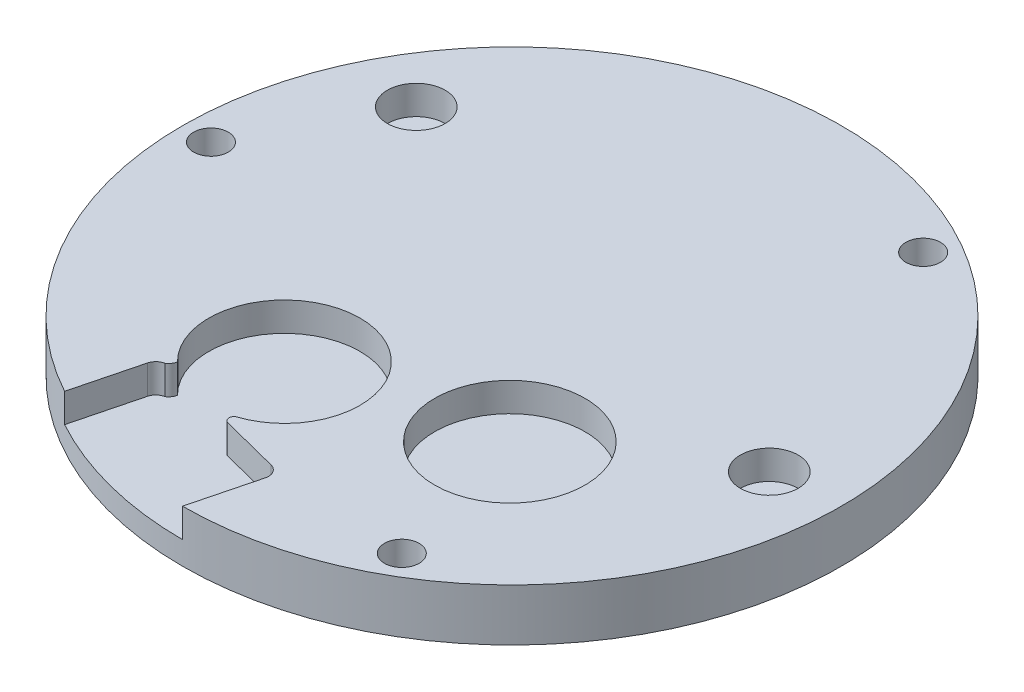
ISO-10303-21;
HEADER;
FILE_DESCRIPTION(('STEP AP214'),'2;1');
FILE_NAME('part.step','',(''),(''),'','','');
FILE_SCHEMA(('AUTOMOTIVE_DESIGN { 1 0 10303 214 1 1 1 1 }'));
ENDSEC;
DATA;
#1=APPLICATION_CONTEXT('core data for automotive mechanical design processes');
#2=APPLICATION_PROTOCOL_DEFINITION('international standard','automotive_design',2000,#1);
#3=PRODUCT_CONTEXT('',#1,'mechanical');
#4=PRODUCT('Part','Part','',(#3));
#5=PRODUCT_RELATED_PRODUCT_CATEGORY('part','',(#4));
#6=PRODUCT_DEFINITION_FORMATION('','',#4);
#7=PRODUCT_DEFINITION_CONTEXT('part definition',#1,'design');
#8=PRODUCT_DEFINITION('design','',#6,#7);
#9=PRODUCT_DEFINITION_SHAPE('','',#8);
#10=(LENGTH_UNIT() NAMED_UNIT(*) SI_UNIT(.MILLI.,.METRE.));
#11=(NAMED_UNIT(*) PLANE_ANGLE_UNIT() SI_UNIT($,.RADIAN.));
#12=(NAMED_UNIT(*) SI_UNIT($,.STERADIAN.) SOLID_ANGLE_UNIT());
#13=UNCERTAINTY_MEASURE_WITH_UNIT(LENGTH_MEASURE(1.E-05),#10,'distance_accuracy_value','');
#14=(GEOMETRIC_REPRESENTATION_CONTEXT(3) GLOBAL_UNCERTAINTY_ASSIGNED_CONTEXT((#13)) GLOBAL_UNIT_ASSIGNED_CONTEXT((#10,
#11,#12)) REPRESENTATION_CONTEXT('',''));
#15=CARTESIAN_POINT('',(0.,0.,0.));
#16=DIRECTION('',(0.,0.,1.));
#17=DIRECTION('',(1.,0.,0.));
#18=AXIS2_PLACEMENT_3D('',#15,#16,#17);
#19=CARTESIAN_POINT('',(0.,9.,0.));
#20=DIRECTION('',(0.,-1.,0.));
#21=DIRECTION('',(0.,0.,-1.));
#22=AXIS2_PLACEMENT_3D('',#19,#20,#21);
#23=CYLINDRICAL_SURFACE('',#22,57.);
#24=CARTESIAN_POINT('',(1.52655665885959E-13,4.,-5.62050406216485E-13));
#25=DIRECTION('',(0.,1.,0.));
#26=DIRECTION('',(0.,0.,-1.));
#27=AXIS2_PLACEMENT_3D('',#24,#25,#26);
#28=CIRCLE('',#27,57.0000000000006);
#29=CARTESIAN_POINT('',(-27.404440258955,4.,49.97996252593));
#30=VERTEX_POINT('',#29);
#31=CARTESIAN_POINT('',(0.,4.,57.));
#32=VERTEX_POINT('',#31);
#33=EDGE_CURVE('E180',#30,#32,#28,.T.);
#34=ORIENTED_EDGE('',*,*,#33,.F.);
#35=DIRECTION('',(0.,1.,0.));
#36=VECTOR('',#35,1.);
#37=CARTESIAN_POINT('',(-27.404440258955,4.,49.97996252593));
#38=LINE('',#37,#36);
#39=CARTESIAN_POINT('',(-27.404440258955,9.,49.97996252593));
#40=VERTEX_POINT('',#39);
#41=EDGE_CURVE('E219',#30,#40,#38,.T.);
#42=ORIENTED_EDGE('',*,*,#41,.T.);
#43=CARTESIAN_POINT('',(0.,9.,0.));
#44=DIRECTION('',(0.,1.,0.));
#45=DIRECTION('',(0.,0.,1.));
#46=AXIS2_PLACEMENT_3D('',#43,#44,#45);
#47=CIRCLE('',#46,57.);
#48=CARTESIAN_POINT('',(0.,9.,57.));
#49=VERTEX_POINT('',#48);
#50=EDGE_CURVE('E49',#49,#40,#47,.T.);
#51=ORIENTED_EDGE('',*,*,#50,.F.);
#52=DIRECTION('',(0.,1.,0.));
#53=VECTOR('',#52,1.);
#54=CARTESIAN_POINT('',(0.,4.,57.));
#55=LINE('',#54,#53);
#56=EDGE_CURVE('E64',#32,#49,#55,.T.);
#57=ORIENTED_EDGE('',*,*,#56,.F.);
#58=EDGE_LOOP('',(#34,#42,#51,#57));
#59=FACE_BOUND('',#58,.T.);
#60=CARTESIAN_POINT('',(0.,0.,0.));
#61=DIRECTION('',(0.,1.,0.));
#62=DIRECTION('',(0.,0.,1.));
#63=AXIS2_PLACEMENT_3D('',#60,#61,#62);
#64=CIRCLE('',#63,57.);
#65=CARTESIAN_POINT('',(0.,0.,57.));
#66=VERTEX_POINT('',#65);
#67=EDGE_CURVE('E254',#66,#66,#64,.T.);
#68=ORIENTED_EDGE('',*,*,#67,.T.);
#69=EDGE_LOOP('',(#68));
#70=FACE_BOUND('',#69,.T.);
#71=ADVANCED_FACE('F41',(#59,#70),#23,.T.);
#72=CARTESIAN_POINT('',(0.,9.,0.));
#73=DIRECTION('',(0.,1.,0.));
#74=DIRECTION('',(0.,0.,1.));
#75=AXIS2_PLACEMENT_3D('',#72,#73,#74);
#76=PLANE('',#75);
#77=CARTESIAN_POINT('',(-8.33064167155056,9.,39.7365276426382));
#78=DIRECTION('',(0.,-1.,0.));
#79=DIRECTION('',(0.,0.,1.));
#80=AXIS2_PLACEMENT_3D('',#77,#78,#79);
#81=CIRCLE('',#80,0.881146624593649);
#82=CARTESIAN_POINT('',(-8.65172272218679,9.,40.5570922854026));
#83=VERTEX_POINT('',#82);
#84=CARTESIAN_POINT('',(-8.77437966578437,9.,38.9752681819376));
#85=VERTEX_POINT('',#84);
#86=EDGE_CURVE('E317',#83,#85,#81,.T.);
#87=ORIENTED_EDGE('',*,*,#86,.F.);
#88=DIRECTION('',(-0.968721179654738,0.,-0.248151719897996));
#89=VECTOR('',#88,1.);
#90=CARTESIAN_POINT('',(1.48249855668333,9.,43.1531173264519));
#91=LINE('',#90,#89);
#92=CARTESIAN_POINT('',(1.48249855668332,9.,43.1531173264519));
#93=VERTEX_POINT('',#92);
#94=EDGE_CURVE('E211',#93,#83,#91,.T.);
#95=ORIENTED_EDGE('',*,*,#94,.F.);
#96=CARTESIAN_POINT('',(0.986195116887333,9.,45.0905596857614));
#97=DIRECTION('',(0.,1.,0.));
#98=DIRECTION('',(0.,0.,1.));
#99=AXIS2_PLACEMENT_3D('',#96,#97,#98);
#100=CIRCLE('',#99,2.);
#101=CARTESIAN_POINT('',(2.92363747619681,9.,45.5868631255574));
#102=VERTEX_POINT('',#101);
#103=EDGE_CURVE('E206',#102,#93,#100,.T.);
#104=ORIENTED_EDGE('',*,*,#103,.F.);
#105=DIRECTION('',(0.248151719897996,0.,-0.968721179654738));
#106=VECTOR('',#105,1.);
#107=CARTESIAN_POINT('',(0.,9.,57.));
#108=LINE('',#107,#106);
#109=EDGE_CURVE('E203',#49,#102,#108,.T.);
#110=ORIENTED_EDGE('',*,*,#109,.F.);
#111=ORIENTED_EDGE('',*,*,#50,.T.);
#112=DIRECTION('',(-0.248151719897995,0.,0.968721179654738));
#113=VECTOR('',#112,1.);
#114=CARTESIAN_POINT('',(-27.404440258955,9.,49.97996252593));
#115=LINE('',#114,#113);
#116=CARTESIAN_POINT('',(-24.4808027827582,9.,38.5668256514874));
#117=VERTEX_POINT('',#116);
#118=EDGE_CURVE('E185',#117,#40,#115,.T.);
#119=ORIENTED_EDGE('',*,*,#118,.F.);
#120=CARTESIAN_POINT('',(-22.5433604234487,9.,39.0631290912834));
#121=DIRECTION('',(0.,1.,0.));
#122=DIRECTION('',(0.,0.,-1.));
#123=AXIS2_PLACEMENT_3D('',#120,#121,#122);
#124=CIRCLE('',#123,2.);
#125=CARTESIAN_POINT('',(-22.9243420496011,9.,37.0997511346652));
#126=VERTEX_POINT('',#125);
#127=EDGE_CURVE('E214',#126,#117,#124,.T.);
#128=ORIENTED_EDGE('',*,*,#127,.F.);
#129=CARTESIAN_POINT('',(-23.9022584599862,9.,35.4870514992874));
#130=DIRECTION('',(0.,-1.,0.));
#131=DIRECTION('',(0.,0.,1.));
#132=AXIS2_PLACEMENT_3D('',#129,#130,#131);
#133=CIRCLE('',#132,1.88603303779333);
#134=CARTESIAN_POINT('',(-22.045034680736,9.,35.8154422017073));
#135=VERTEX_POINT('',#134);
#136=EDGE_CURVE('E140',#135,#126,#133,.T.);
#137=ORIENTED_EDGE('',*,*,#136,.F.);
#138=CARTESIAN_POINT('',(-12.8244297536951,9.,26.53769247));
#139=DIRECTION('',(0.,1.,0.));
#140=DIRECTION('',(0.,0.,1.));
#141=AXIS2_PLACEMENT_3D('',#138,#139,#140);
#142=CIRCLE('',#141,13.0803744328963);
#143=EDGE_CURVE('E121',#85,#135,#142,.T.);
#144=ORIENTED_EDGE('',*,*,#143,.F.);
#145=EDGE_LOOP('',(#87,#95,#104,#110,#111,#119,#128,#137,#144));
#146=FACE_BOUND('',#145,.T.);
#147=CARTESIAN_POINT('',(18.6584441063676,9.,19.02768238));
#148=DIRECTION('',(0.,1.,0.));
#149=DIRECTION('',(0.,0.,1.));
#150=AXIS2_PLACEMENT_3D('',#147,#148,#149);
#151=CIRCLE('',#150,13.0067711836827);
#152=CARTESIAN_POINT('',(18.6584441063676,9.,32.0344535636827));
#153=VERTEX_POINT('',#152);
#154=EDGE_CURVE('E145',#153,#153,#151,.T.);
#155=ORIENTED_EDGE('',*,*,#154,.F.);
#156=EDGE_LOOP('',(#155));
#157=FACE_BOUND('',#156,.T.);
#158=CARTESIAN_POINT('',(26.0343828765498,9.,-45.0928738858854));
#159=DIRECTION('',(0.,1.,0.));
#160=DIRECTION('',(0.,0.,1.));
#161=AXIS2_PLACEMENT_3D('',#158,#159,#160);
#162=CIRCLE('',#161,3.);
#163=CARTESIAN_POINT('',(26.0343828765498,9.,-42.0928738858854));
#164=VERTEX_POINT('',#163);
#165=EDGE_CURVE('E161',#164,#164,#162,.T.);
#166=ORIENTED_EDGE('',*,*,#165,.F.);
#167=EDGE_LOOP('',(#166));
#168=FACE_BOUND('',#167,.T.);
#169=CARTESIAN_POINT('',(26.0343828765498,9.,45.0928738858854));
#170=DIRECTION('',(0.,1.,0.));
#171=DIRECTION('',(0.,0.,1.));
#172=AXIS2_PLACEMENT_3D('',#169,#170,#171);
#173=CIRCLE('',#172,3.);
#174=CARTESIAN_POINT('',(26.0343828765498,9.,48.0928738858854));
#175=VERTEX_POINT('',#174);
#176=EDGE_CURVE('E169',#175,#175,#173,.T.);
#177=ORIENTED_EDGE('',*,*,#176,.F.);
#178=EDGE_LOOP('',(#177));
#179=FACE_BOUND('',#178,.T.);
#180=CARTESIAN_POINT('',(-52.0687657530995,9.,0.));
#181=DIRECTION('',(0.,1.,0.));
#182=DIRECTION('',(0.,0.,1.));
#183=AXIS2_PLACEMENT_3D('',#180,#181,#182);
#184=CIRCLE('',#183,3.);
#185=CARTESIAN_POINT('',(-52.0687657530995,9.,3.));
#186=VERTEX_POINT('',#185);
#187=EDGE_CURVE('E120',#186,#186,#184,.T.);
#188=ORIENTED_EDGE('',*,*,#187,.F.);
#189=EDGE_LOOP('',(#188));
#190=FACE_BOUND('',#189,.T.);
#191=CARTESIAN_POINT('',(-39.5949139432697,9.,-23.0415780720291));
#192=DIRECTION('',(0.,1.,0.));
#193=DIRECTION('',(0.,0.,1.));
#194=AXIS2_PLACEMENT_3D('',#191,#192,#193);
#195=CIRCLE('',#194,5.);
#196=CARTESIAN_POINT('',(-39.5949139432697,9.,-18.0415780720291));
#197=VERTEX_POINT('',#196);
#198=EDGE_CURVE('E239',#197,#197,#195,.T.);
#199=ORIENTED_EDGE('',*,*,#198,.F.);
#200=EDGE_LOOP('',(#199));
#201=FACE_BOUND('',#200,.T.);
#202=CARTESIAN_POINT('',(45.584060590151,9.,1.08137370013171));
#203=DIRECTION('',(0.,1.,0.));
#204=DIRECTION('',(0.,0.,1.));
#205=AXIS2_PLACEMENT_3D('',#202,#203,#204);
#206=CIRCLE('',#205,5.);
#207=CARTESIAN_POINT('',(45.584060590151,9.,6.08137370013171));
#208=VERTEX_POINT('',#207);
#209=EDGE_CURVE('E160',#208,#208,#206,.T.);
#210=ORIENTED_EDGE('',*,*,#209,.F.);
#211=EDGE_LOOP('',(#210));
#212=FACE_BOUND('',#211,.T.);
#213=ADVANCED_FACE('F276',(#146,#157,#168,#179,#190,#201,#212),#76,.T.);
#214=CARTESIAN_POINT('',(0.,0.,0.));
#215=DIRECTION('',(0.,1.,0.));
#216=DIRECTION('',(0.,0.,1.));
#217=AXIS2_PLACEMENT_3D('',#214,#215,#216);
#218=PLANE('',#217);
#219=CARTESIAN_POINT('',(0.,0.,0.));
#220=DIRECTION('',(0.,-1.,0.));
#221=DIRECTION('',(0.,0.,-1.));
#222=AXIS2_PLACEMENT_3D('',#219,#220,#221);
#223=CIRCLE('',#222,4.75);
#224=CARTESIAN_POINT('',(0.,0.,-4.75));
#225=VERTEX_POINT('',#224);
#226=EDGE_CURVE('E255',#225,#225,#223,.T.);
#227=ORIENTED_EDGE('',*,*,#226,.F.);
#228=EDGE_LOOP('',(#227));
#229=FACE_BOUND('',#228,.T.);
#230=CARTESIAN_POINT('',(0.,0.,-13.5283356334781));
#231=DIRECTION('',(0.,-1.,0.));
#232=DIRECTION('',(0.,0.,-1.));
#233=AXIS2_PLACEMENT_3D('',#230,#231,#232);
#234=CIRCLE('',#233,3.34536233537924);
#235=CARTESIAN_POINT('',(0.,0.,-16.8736979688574));
#236=VERTEX_POINT('',#235);
#237=EDGE_CURVE('E223',#236,#236,#234,.T.);
#238=ORIENTED_EDGE('',*,*,#237,.F.);
#239=EDGE_LOOP('',(#238));
#240=FACE_BOUND('',#239,.T.);
#241=ORIENTED_EDGE('',*,*,#67,.F.);
#242=EDGE_LOOP('',(#241));
#243=FACE_BOUND('',#242,.T.);
#244=ADVANCED_FACE('F273',(#229,#240,#243),#218,.F.);
#245=CARTESIAN_POINT('',(0.,8.,-13.5283356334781));
#246=DIRECTION('',(0.,-1.,0.));
#247=DIRECTION('',(0.,0.,-1.));
#248=AXIS2_PLACEMENT_3D('',#245,#246,#247);
#249=CYLINDRICAL_SURFACE('',#248,3.34536233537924);
#250=CARTESIAN_POINT('',(0.,8.,-13.5283356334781));
#251=DIRECTION('',(0.,-1.,0.));
#252=DIRECTION('',(0.,0.,-1.));
#253=AXIS2_PLACEMENT_3D('',#250,#251,#252);
#254=CIRCLE('',#253,3.34536233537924);
#255=CARTESIAN_POINT('',(0.,8.,-16.8736979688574));
#256=VERTEX_POINT('',#255);
#257=EDGE_CURVE('E259',#256,#256,#254,.T.);
#258=ORIENTED_EDGE('',*,*,#257,.F.);
#259=EDGE_LOOP('',(#258));
#260=FACE_BOUND('',#259,.T.);
#261=ORIENTED_EDGE('',*,*,#237,.T.);
#262=EDGE_LOOP('',(#261));
#263=FACE_BOUND('',#262,.T.);
#264=ADVANCED_FACE('F275',(#260,#263),#249,.F.);
#265=CARTESIAN_POINT('',(0.,8.,-13.5283356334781));
#266=DIRECTION('',(0.,-1.,0.));
#267=DIRECTION('',(0.,0.,-1.));
#268=AXIS2_PLACEMENT_3D('',#265,#266,#267);
#269=PLANE('',#268);
#270=ORIENTED_EDGE('',*,*,#257,.T.);
#271=EDGE_LOOP('',(#270));
#272=FACE_BOUND('',#271,.T.);
#273=ADVANCED_FACE('F282',(#272),#269,.T.);
#274=CARTESIAN_POINT('',(0.,8.,0.));
#275=DIRECTION('',(0.,-1.,0.));
#276=DIRECTION('',(0.,0.,-1.));
#277=AXIS2_PLACEMENT_3D('',#274,#275,#276);
#278=CYLINDRICAL_SURFACE('',#277,4.75);
#279=CARTESIAN_POINT('',(0.,8.,0.));
#280=DIRECTION('',(0.,-1.,0.));
#281=DIRECTION('',(0.,0.,-1.));
#282=AXIS2_PLACEMENT_3D('',#279,#280,#281);
#283=CIRCLE('',#282,4.75);
#284=CARTESIAN_POINT('',(0.,8.,-4.75));
#285=VERTEX_POINT('',#284);
#286=EDGE_CURVE('E250',#285,#285,#283,.T.);
#287=ORIENTED_EDGE('',*,*,#286,.F.);
#288=EDGE_LOOP('',(#287));
#289=FACE_BOUND('',#288,.T.);
#290=ORIENTED_EDGE('',*,*,#226,.T.);
#291=EDGE_LOOP('',(#290));
#292=FACE_BOUND('',#291,.T.);
#293=ADVANCED_FACE('F355',(#289,#292),#278,.F.);
#294=CARTESIAN_POINT('',(0.,8.,0.));
#295=DIRECTION('',(0.,-1.,0.));
#296=DIRECTION('',(0.,0.,-1.));
#297=AXIS2_PLACEMENT_3D('',#294,#295,#296);
#298=PLANE('',#297);
#299=ORIENTED_EDGE('',*,*,#286,.T.);
#300=EDGE_LOOP('',(#299));
#301=FACE_BOUND('',#300,.T.);
#302=ADVANCED_FACE('F351',(#301),#298,.T.);
#303=CARTESIAN_POINT('',(45.584060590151,4.,1.08137370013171));
#304=DIRECTION('',(0.,1.,0.));
#305=DIRECTION('',(0.,0.,1.));
#306=AXIS2_PLACEMENT_3D('',#303,#304,#305);
#307=CYLINDRICAL_SURFACE('',#306,5.);
#308=CARTESIAN_POINT('',(45.584060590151,4.,1.08137370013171));
#309=DIRECTION('',(0.,1.,0.));
#310=DIRECTION('',(0.,0.,1.));
#311=AXIS2_PLACEMENT_3D('',#308,#309,#310);
#312=CIRCLE('',#311,5.);
#313=CARTESIAN_POINT('',(45.584060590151,4.,6.08137370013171));
#314=VERTEX_POINT('',#313);
#315=EDGE_CURVE('E243',#314,#314,#312,.T.);
#316=ORIENTED_EDGE('',*,*,#315,.F.);
#317=EDGE_LOOP('',(#316));
#318=FACE_BOUND('',#317,.T.);
#319=ORIENTED_EDGE('',*,*,#209,.T.);
#320=EDGE_LOOP('',(#319));
#321=FACE_BOUND('',#320,.T.);
#322=ADVANCED_FACE('F347',(#318,#321),#307,.F.);
#323=CARTESIAN_POINT('',(45.584060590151,4.,1.08137370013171));
#324=DIRECTION('',(0.,1.,0.));
#325=DIRECTION('',(0.,0.,1.));
#326=AXIS2_PLACEMENT_3D('',#323,#324,#325);
#327=PLANE('',#326);
#328=ORIENTED_EDGE('',*,*,#315,.T.);
#329=EDGE_LOOP('',(#328));
#330=FACE_BOUND('',#329,.T.);
#331=ADVANCED_FACE('F343',(#330),#327,.T.);
#332=CARTESIAN_POINT('',(-39.5949139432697,4.,-23.0415780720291));
#333=DIRECTION('',(0.,1.,0.));
#334=DIRECTION('',(0.,0.,1.));
#335=AXIS2_PLACEMENT_3D('',#332,#333,#334);
#336=CYLINDRICAL_SURFACE('',#335,5.);
#337=CARTESIAN_POINT('',(-39.5949139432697,4.,-23.0415780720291));
#338=DIRECTION('',(0.,1.,0.));
#339=DIRECTION('',(0.,0.,1.));
#340=AXIS2_PLACEMENT_3D('',#337,#338,#339);
#341=CIRCLE('',#340,5.);
#342=CARTESIAN_POINT('',(-39.5949139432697,4.,-18.0415780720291));
#343=VERTEX_POINT('',#342);
#344=EDGE_CURVE('E207',#343,#343,#341,.T.);
#345=ORIENTED_EDGE('',*,*,#344,.F.);
#346=EDGE_LOOP('',(#345));
#347=FACE_BOUND('',#346,.T.);
#348=ORIENTED_EDGE('',*,*,#198,.T.);
#349=EDGE_LOOP('',(#348));
#350=FACE_BOUND('',#349,.T.);
#351=ADVANCED_FACE('F339',(#347,#350),#336,.F.);
#352=CARTESIAN_POINT('',(-39.5949139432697,4.,-23.0415780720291));
#353=DIRECTION('',(0.,1.,0.));
#354=DIRECTION('',(0.,0.,1.));
#355=AXIS2_PLACEMENT_3D('',#352,#353,#354);
#356=PLANE('',#355);
#357=ORIENTED_EDGE('',*,*,#344,.T.);
#358=EDGE_LOOP('',(#357));
#359=FACE_BOUND('',#358,.T.);
#360=ADVANCED_FACE('F329',(#359),#356,.T.);
#361=CARTESIAN_POINT('',(-27.404440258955,4.,49.97996252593));
#362=DIRECTION('',(-0.968721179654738,0.,-0.248151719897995));
#363=DIRECTION('',(-0.248151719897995,0.,0.968721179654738));
#364=AXIS2_PLACEMENT_3D('',#361,#362,#363);
#365=PLANE('',#364);
#366=ORIENTED_EDGE('',*,*,#118,.T.);
#367=ORIENTED_EDGE('',*,*,#41,.F.);
#368=DIRECTION('',(-0.248151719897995,0.,0.968721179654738));
#369=VECTOR('',#368,1.);
#370=CARTESIAN_POINT('',(-27.404440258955,4.,49.97996252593));
#371=LINE('',#370,#369);
#372=CARTESIAN_POINT('',(-24.4808027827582,4.,38.5668256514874));
#373=VERTEX_POINT('',#372);
#374=EDGE_CURVE('E199',#373,#30,#371,.T.);
#375=ORIENTED_EDGE('',*,*,#374,.F.);
#376=DIRECTION('',(0.,1.,0.));
#377=VECTOR('',#376,1.);
#378=CARTESIAN_POINT('',(-24.4808027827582,4.,38.5668256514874));
#379=LINE('',#378,#377);
#380=EDGE_CURVE('E224',#373,#117,#379,.T.);
#381=ORIENTED_EDGE('',*,*,#380,.T.);
#382=EDGE_LOOP('',(#366,#367,#375,#381));
#383=FACE_BOUND('',#382,.T.);
#384=ADVANCED_FACE('F298',(#383),#365,.F.);
#385=CARTESIAN_POINT('',(-22.5433604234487,4.,39.0631290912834));
#386=DIRECTION('',(0.,1.,0.));
#387=DIRECTION('',(0.,0.,1.));
#388=AXIS2_PLACEMENT_3D('',#385,#386,#387);
#389=CYLINDRICAL_SURFACE('',#388,2.);
#390=ORIENTED_EDGE('',*,*,#127,.T.);
#391=ORIENTED_EDGE('',*,*,#380,.F.);
#392=CARTESIAN_POINT('',(-22.5433604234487,4.,39.0631290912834));
#393=DIRECTION('',(0.,1.,0.));
#394=DIRECTION('',(0.,0.,-1.));
#395=AXIS2_PLACEMENT_3D('',#392,#393,#394);
#396=CIRCLE('',#395,2.);
#397=CARTESIAN_POINT('',(-22.9243420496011,4.,37.0997511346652));
#398=VERTEX_POINT('',#397);
#399=EDGE_CURVE('E196',#398,#373,#396,.T.);
#400=ORIENTED_EDGE('',*,*,#399,.F.);
#401=DIRECTION('',(0.,1.,0.));
#402=VECTOR('',#401,1.);
#403=CARTESIAN_POINT('',(-22.9243420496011,6.5,37.0997511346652));
#404=LINE('',#403,#402);
#405=EDGE_CURVE('E129',#398,#126,#404,.T.);
#406=ORIENTED_EDGE('',*,*,#405,.T.);
#407=EDGE_LOOP('',(#390,#391,#400,#406));
#408=FACE_BOUND('',#407,.T.);
#409=ADVANCED_FACE('F321',(#408),#389,.F.);
#410=CARTESIAN_POINT('',(1.48249855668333,4.,43.1531173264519));
#411=DIRECTION('',(0.248151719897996,0.,-0.968721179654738));
#412=DIRECTION('',(-0.968721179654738,0.,-0.248151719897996));
#413=AXIS2_PLACEMENT_3D('',#410,#411,#412);
#414=PLANE('',#413);
#415=ORIENTED_EDGE('',*,*,#94,.T.);
#416=DIRECTION('',(0.,1.,0.));
#417=VECTOR('',#416,1.);
#418=CARTESIAN_POINT('',(-8.6517227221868,4.,40.5570922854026));
#419=LINE('',#418,#417);
#420=CARTESIAN_POINT('',(-8.65172272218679,4.,40.5570922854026));
#421=VERTEX_POINT('',#420);
#422=EDGE_CURVE('E137',#83,#421,#419,.F.);
#423=ORIENTED_EDGE('',*,*,#422,.T.);
#424=DIRECTION('',(-0.968721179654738,0.,-0.248151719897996));
#425=VECTOR('',#424,1.);
#426=CARTESIAN_POINT('',(1.48249855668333,4.,43.1531173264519));
#427=LINE('',#426,#425);
#428=CARTESIAN_POINT('',(1.48249855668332,4.,43.1531173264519));
#429=VERTEX_POINT('',#428);
#430=EDGE_CURVE('E193',#429,#421,#427,.T.);
#431=ORIENTED_EDGE('',*,*,#430,.F.);
#432=DIRECTION('',(0.,1.,0.));
#433=VECTOR('',#432,1.);
#434=CARTESIAN_POINT('',(1.48249855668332,4.,43.1531173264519));
#435=LINE('',#434,#433);
#436=EDGE_CURVE('E228',#429,#93,#435,.T.);
#437=ORIENTED_EDGE('',*,*,#436,.T.);
#438=EDGE_LOOP('',(#415,#423,#431,#437));
#439=FACE_BOUND('',#438,.T.);
#440=ADVANCED_FACE('F316',(#439),#414,.F.);
#441=CARTESIAN_POINT('',(0.986195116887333,4.,45.0905596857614));
#442=DIRECTION('',(0.,1.,0.));
#443=DIRECTION('',(0.,0.,1.));
#444=AXIS2_PLACEMENT_3D('',#441,#442,#443);
#445=CYLINDRICAL_SURFACE('',#444,2.);
#446=ORIENTED_EDGE('',*,*,#103,.T.);
#447=ORIENTED_EDGE('',*,*,#436,.F.);
#448=CARTESIAN_POINT('',(0.986195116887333,4.,45.0905596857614));
#449=DIRECTION('',(0.,1.,0.));
#450=DIRECTION('',(0.,0.,1.));
#451=AXIS2_PLACEMENT_3D('',#448,#449,#450);
#452=CIRCLE('',#451,2.);
#453=CARTESIAN_POINT('',(2.92363747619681,4.,45.5868631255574));
#454=VERTEX_POINT('',#453);
#455=EDGE_CURVE('E189',#454,#429,#452,.T.);
#456=ORIENTED_EDGE('',*,*,#455,.F.);
#457=DIRECTION('',(0.,1.,0.));
#458=VECTOR('',#457,1.);
#459=CARTESIAN_POINT('',(2.92363747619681,4.,45.5868631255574));
#460=LINE('',#459,#458);
#461=EDGE_CURVE('E231',#454,#102,#460,.T.);
#462=ORIENTED_EDGE('',*,*,#461,.T.);
#463=EDGE_LOOP('',(#446,#447,#456,#462));
#464=FACE_BOUND('',#463,.T.);
#465=ADVANCED_FACE('F308',(#464),#445,.F.);
#466=CARTESIAN_POINT('',(0.,4.,57.));
#467=DIRECTION('',(0.968721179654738,0.,0.248151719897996));
#468=DIRECTION('',(0.248151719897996,0.,-0.968721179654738));
#469=AXIS2_PLACEMENT_3D('',#466,#467,#468);
#470=PLANE('',#469);
#471=ORIENTED_EDGE('',*,*,#109,.T.);
#472=ORIENTED_EDGE('',*,*,#461,.F.);
#473=DIRECTION('',(0.248151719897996,0.,-0.968721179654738));
#474=VECTOR('',#473,1.);
#475=CARTESIAN_POINT('',(0.,4.,57.));
#476=LINE('',#475,#474);
#477=EDGE_CURVE('E184',#32,#454,#476,.T.);
#478=ORIENTED_EDGE('',*,*,#477,.F.);
#479=ORIENTED_EDGE('',*,*,#56,.T.);
#480=EDGE_LOOP('',(#471,#472,#478,#479));
#481=FACE_BOUND('',#480,.T.);
#482=ADVANCED_FACE('F305',(#481),#470,.F.);
#483=CARTESIAN_POINT('',(1.52655665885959E-13,4.,-5.62050406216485E-13));
#484=DIRECTION('',(0.,-1.,0.));
#485=DIRECTION('',(0.,0.,-1.));
#486=AXIS2_PLACEMENT_3D('',#483,#484,#485);
#487=PLANE('',#486);
#488=CARTESIAN_POINT('',(-23.9022584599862,4.,35.4870514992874));
#489=DIRECTION('',(0.,-1.,0.));
#490=DIRECTION('',(0.,0.,1.));
#491=AXIS2_PLACEMENT_3D('',#488,#489,#490);
#492=CIRCLE('',#491,1.88603303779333);
#493=CARTESIAN_POINT('',(-22.045034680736,4.,35.8154422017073));
#494=VERTEX_POINT('',#493);
#495=EDGE_CURVE('E115',#494,#398,#492,.T.);
#496=ORIENTED_EDGE('',*,*,#495,.T.);
#497=ORIENTED_EDGE('',*,*,#399,.T.);
#498=ORIENTED_EDGE('',*,*,#374,.T.);
#499=ORIENTED_EDGE('',*,*,#33,.T.);
#500=ORIENTED_EDGE('',*,*,#477,.T.);
#501=ORIENTED_EDGE('',*,*,#455,.T.);
#502=ORIENTED_EDGE('',*,*,#430,.T.);
#503=CARTESIAN_POINT('',(-8.33064167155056,4.,39.7365276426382));
#504=DIRECTION('',(0.,-1.,0.));
#505=DIRECTION('',(0.,0.,1.));
#506=AXIS2_PLACEMENT_3D('',#503,#504,#505);
#507=CIRCLE('',#506,0.881146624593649);
#508=CARTESIAN_POINT('',(-8.77437966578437,4.,38.9752681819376));
#509=VERTEX_POINT('',#508);
#510=EDGE_CURVE('E56',#421,#509,#507,.T.);
#511=ORIENTED_EDGE('',*,*,#510,.T.);
#512=CARTESIAN_POINT('',(-12.8244297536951,4.,26.53769247));
#513=DIRECTION('',(0.,1.,0.));
#514=DIRECTION('',(0.,0.,1.));
#515=AXIS2_PLACEMENT_3D('',#512,#513,#514);
#516=CIRCLE('',#515,13.0803744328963);
#517=EDGE_CURVE('E112',#509,#494,#516,.T.);
#518=ORIENTED_EDGE('',*,*,#517,.T.);
#519=EDGE_LOOP('',(#496,#497,#498,#499,#500,#501,#502,#511,#518));
#520=FACE_BOUND('',#519,.T.);
#521=ADVANCED_FACE('F114',(#520),#487,.F.);
#522=CARTESIAN_POINT('',(-52.0687657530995,0.999999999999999,0.));
#523=DIRECTION('',(0.,1.,0.));
#524=DIRECTION('',(0.,0.,1.));
#525=AXIS2_PLACEMENT_3D('',#522,#523,#524);
#526=CYLINDRICAL_SURFACE('',#525,3.);
#527=CARTESIAN_POINT('',(-52.0687657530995,0.999999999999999,0.));
#528=DIRECTION('',(0.,1.,0.));
#529=DIRECTION('',(0.,0.,1.));
#530=AXIS2_PLACEMENT_3D('',#527,#528,#529);
#531=CIRCLE('',#530,3.);
#532=CARTESIAN_POINT('',(-52.0687657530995,0.999999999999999,3.));
#533=VERTEX_POINT('',#532);
#534=EDGE_CURVE('E173',#533,#533,#531,.T.);
#535=ORIENTED_EDGE('',*,*,#534,.F.);
#536=EDGE_LOOP('',(#535));
#537=FACE_BOUND('',#536,.T.);
#538=ORIENTED_EDGE('',*,*,#187,.T.);
#539=EDGE_LOOP('',(#538));
#540=FACE_BOUND('',#539,.T.);
#541=ADVANCED_FACE('F420',(#537,#540),#526,.F.);
#542=CARTESIAN_POINT('',(-52.0687657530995,0.999999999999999,0.));
#543=DIRECTION('',(0.,1.,0.));
#544=DIRECTION('',(0.,0.,1.));
#545=AXIS2_PLACEMENT_3D('',#542,#543,#544);
#546=PLANE('',#545);
#547=ORIENTED_EDGE('',*,*,#534,.T.);
#548=EDGE_LOOP('',(#547));
#549=FACE_BOUND('',#548,.T.);
#550=ADVANCED_FACE('F425',(#549),#546,.T.);
#551=CARTESIAN_POINT('',(26.0343828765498,0.999999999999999,45.0928738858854));
#552=DIRECTION('',(0.,1.,0.));
#553=DIRECTION('',(0.,0.,1.));
#554=AXIS2_PLACEMENT_3D('',#551,#552,#553);
#555=CYLINDRICAL_SURFACE('',#554,3.);
#556=CARTESIAN_POINT('',(26.0343828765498,0.999999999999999,45.0928738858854));
#557=DIRECTION('',(0.,1.,0.));
#558=DIRECTION('',(0.,0.,1.));
#559=AXIS2_PLACEMENT_3D('',#556,#557,#558);
#560=CIRCLE('',#559,3.);
#561=CARTESIAN_POINT('',(26.0343828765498,0.999999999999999,48.0928738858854));
#562=VERTEX_POINT('',#561);
#563=EDGE_CURVE('E165',#562,#562,#560,.T.);
#564=ORIENTED_EDGE('',*,*,#563,.F.);
#565=EDGE_LOOP('',(#564));
#566=FACE_BOUND('',#565,.T.);
#567=ORIENTED_EDGE('',*,*,#176,.T.);
#568=EDGE_LOOP('',(#567));
#569=FACE_BOUND('',#568,.T.);
#570=ADVANCED_FACE('F435',(#566,#569),#555,.F.);
#571=CARTESIAN_POINT('',(26.0343828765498,0.999999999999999,45.0928738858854));
#572=DIRECTION('',(0.,1.,0.));
#573=DIRECTION('',(0.,0.,1.));
#574=AXIS2_PLACEMENT_3D('',#571,#572,#573);
#575=PLANE('',#574);
#576=ORIENTED_EDGE('',*,*,#563,.T.);
#577=EDGE_LOOP('',(#576));
#578=FACE_BOUND('',#577,.T.);
#579=ADVANCED_FACE('F445',(#578),#575,.T.);
#580=CARTESIAN_POINT('',(26.0343828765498,0.999999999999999,-45.0928738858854));
#581=DIRECTION('',(0.,1.,0.));
#582=DIRECTION('',(0.,0.,1.));
#583=AXIS2_PLACEMENT_3D('',#580,#581,#582);
#584=CYLINDRICAL_SURFACE('',#583,3.);
#585=CARTESIAN_POINT('',(26.0343828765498,0.999999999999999,-45.0928738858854));
#586=DIRECTION('',(0.,1.,0.));
#587=DIRECTION('',(0.,0.,1.));
#588=AXIS2_PLACEMENT_3D('',#585,#586,#587);
#589=CIRCLE('',#588,3.);
#590=CARTESIAN_POINT('',(26.0343828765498,0.999999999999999,-42.0928738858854));
#591=VERTEX_POINT('',#590);
#592=EDGE_CURVE('E156',#591,#591,#589,.T.);
#593=ORIENTED_EDGE('',*,*,#592,.F.);
#594=EDGE_LOOP('',(#593));
#595=FACE_BOUND('',#594,.T.);
#596=ORIENTED_EDGE('',*,*,#165,.T.);
#597=EDGE_LOOP('',(#596));
#598=FACE_BOUND('',#597,.T.);
#599=ADVANCED_FACE('F455',(#595,#598),#584,.F.);
#600=CARTESIAN_POINT('',(26.0343828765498,0.999999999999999,-45.0928738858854));
#601=DIRECTION('',(0.,1.,0.));
#602=DIRECTION('',(0.,0.,1.));
#603=AXIS2_PLACEMENT_3D('',#600,#601,#602);
#604=PLANE('',#603);
#605=ORIENTED_EDGE('',*,*,#592,.T.);
#606=EDGE_LOOP('',(#605));
#607=FACE_BOUND('',#606,.T.);
#608=ADVANCED_FACE('F465',(#607),#604,.T.);
#609=CARTESIAN_POINT('',(-12.8244297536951,4.,26.53769247));
#610=DIRECTION('',(0.,1.,0.));
#611=DIRECTION('',(0.,0.,1.));
#612=AXIS2_PLACEMENT_3D('',#609,#610,#611);
#613=CYLINDRICAL_SURFACE('',#612,13.0803744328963);
#614=ORIENTED_EDGE('',*,*,#143,.T.);
#615=DIRECTION('',(0.,1.,0.));
#616=VECTOR('',#615,1.);
#617=CARTESIAN_POINT('',(-22.045034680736,4.,35.8154422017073));
#618=LINE('',#617,#616);
#619=EDGE_CURVE('E126',#494,#135,#618,.T.);
#620=ORIENTED_EDGE('',*,*,#619,.F.);
#621=ORIENTED_EDGE('',*,*,#517,.F.);
#622=DIRECTION('',(0.,1.,0.));
#623=VECTOR('',#622,1.);
#624=CARTESIAN_POINT('',(-8.77437966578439,6.5,38.9752681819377));
#625=LINE('',#624,#623);
#626=EDGE_CURVE('E11',#509,#85,#625,.T.);
#627=ORIENTED_EDGE('',*,*,#626,.T.);
#628=EDGE_LOOP('',(#614,#620,#621,#627));
#629=FACE_BOUND('',#628,.T.);
#630=ADVANCED_FACE('F132',(#629),#613,.F.);
#631=CARTESIAN_POINT('',(18.6584441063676,4.,19.02768238));
#632=DIRECTION('',(0.,1.,0.));
#633=DIRECTION('',(0.,0.,1.));
#634=AXIS2_PLACEMENT_3D('',#631,#632,#633);
#635=CYLINDRICAL_SURFACE('',#634,13.0067711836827);
#636=CARTESIAN_POINT('',(18.6584441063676,4.,19.02768238));
#637=DIRECTION('',(0.,1.,0.));
#638=DIRECTION('',(0.,0.,1.));
#639=AXIS2_PLACEMENT_3D('',#636,#637,#638);
#640=CIRCLE('',#639,13.0067711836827);
#641=CARTESIAN_POINT('',(18.6584441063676,4.,32.0344535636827));
#642=VERTEX_POINT('',#641);
#643=EDGE_CURVE('E149',#642,#642,#640,.T.);
#644=ORIENTED_EDGE('',*,*,#643,.F.);
#645=EDGE_LOOP('',(#644));
#646=FACE_BOUND('',#645,.T.);
#647=ORIENTED_EDGE('',*,*,#154,.T.);
#648=EDGE_LOOP('',(#647));
#649=FACE_BOUND('',#648,.T.);
#650=ADVANCED_FACE('F482',(#646,#649),#635,.F.);
#651=CARTESIAN_POINT('',(18.6584441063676,4.,19.02768238));
#652=DIRECTION('',(0.,1.,0.));
#653=DIRECTION('',(0.,0.,1.));
#654=AXIS2_PLACEMENT_3D('',#651,#652,#653);
#655=PLANE('',#654);
#656=ORIENTED_EDGE('',*,*,#643,.T.);
#657=EDGE_LOOP('',(#656));
#658=FACE_BOUND('',#657,.T.);
#659=ADVANCED_FACE('F487',(#658),#655,.T.);
#660=CARTESIAN_POINT('',(-23.9022584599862,4.,35.4870514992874));
#661=DIRECTION('',(0.,1.,0.));
#662=DIRECTION('',(0.,0.,1.));
#663=AXIS2_PLACEMENT_3D('',#660,#661,#662);
#664=CYLINDRICAL_SURFACE('',#663,1.88603303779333);
#665=ORIENTED_EDGE('',*,*,#495,.F.);
#666=ORIENTED_EDGE('',*,*,#619,.T.);
#667=ORIENTED_EDGE('',*,*,#136,.T.);
#668=ORIENTED_EDGE('',*,*,#405,.F.);
#669=EDGE_LOOP('',(#665,#666,#667,#668));
#670=FACE_BOUND('',#669,.T.);
#671=ADVANCED_FACE('F125',(#670),#664,.T.);
#672=CARTESIAN_POINT('',(-8.33064167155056,4.,39.7365276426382));
#673=DIRECTION('',(0.,1.,0.));
#674=DIRECTION('',(0.,0.,1.));
#675=AXIS2_PLACEMENT_3D('',#672,#673,#674);
#676=CYLINDRICAL_SURFACE('',#675,0.881146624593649);
#677=ORIENTED_EDGE('',*,*,#86,.T.);
#678=ORIENTED_EDGE('',*,*,#626,.F.);
#679=ORIENTED_EDGE('',*,*,#510,.F.);
#680=ORIENTED_EDGE('',*,*,#422,.F.);
#681=EDGE_LOOP('',(#677,#678,#679,#680));
#682=FACE_BOUND('',#681,.T.);
#683=ADVANCED_FACE('F313',(#682),#676,.T.);
#684=CLOSED_SHELL('',(#71,#213,#244,#264,#273,#293,#302,#322,#331,#351,#360,#384,#409,#440,#465,
#482,#521,#541,#550,#570,#579,#599,#608,#630,#650,#659,#671,#683));
#685=MANIFOLD_SOLID_BREP('B2',#684);
#686=ADVANCED_BREP_SHAPE_REPRESENTATION('',(#18,#685),#14);
#687=SHAPE_DEFINITION_REPRESENTATION(#9,#686);
ENDSEC;
END-ISO-10303-21;
